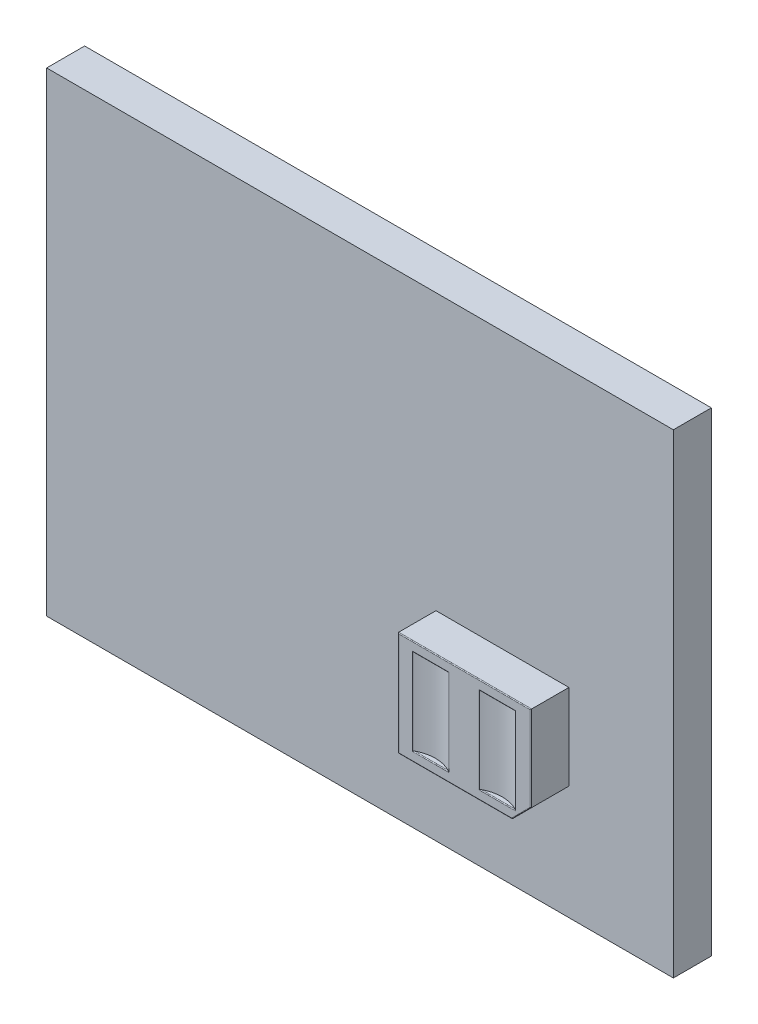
ISO-10303-21;
HEADER;
FILE_DESCRIPTION(('STEP AP214'),'2;1');
FILE_NAME('part.step','',(''),(''),'','','');
FILE_SCHEMA(('AUTOMOTIVE_DESIGN { 1 0 10303 214 1 1 1 1 }'));
ENDSEC;
DATA;
#1=APPLICATION_CONTEXT('core data for automotive mechanical design processes');
#2=APPLICATION_PROTOCOL_DEFINITION('international standard','automotive_design',2000,#1);
#3=PRODUCT_CONTEXT('',#1,'mechanical');
#4=PRODUCT('Part','Part','',(#3));
#5=PRODUCT_RELATED_PRODUCT_CATEGORY('part','',(#4));
#6=PRODUCT_DEFINITION_FORMATION('','',#4);
#7=PRODUCT_DEFINITION_CONTEXT('part definition',#1,'design');
#8=PRODUCT_DEFINITION('design','',#6,#7);
#9=PRODUCT_DEFINITION_SHAPE('','',#8);
#10=(LENGTH_UNIT() NAMED_UNIT(*) SI_UNIT(.MILLI.,.METRE.));
#11=(NAMED_UNIT(*) PLANE_ANGLE_UNIT() SI_UNIT($,.RADIAN.));
#12=(NAMED_UNIT(*) SI_UNIT($,.STERADIAN.) SOLID_ANGLE_UNIT());
#13=UNCERTAINTY_MEASURE_WITH_UNIT(LENGTH_MEASURE(1.E-05),#10,'distance_accuracy_value','');
#14=(GEOMETRIC_REPRESENTATION_CONTEXT(3) GLOBAL_UNCERTAINTY_ASSIGNED_CONTEXT((#13)) GLOBAL_UNIT_ASSIGNED_CONTEXT((#10,
#11,#12)) REPRESENTATION_CONTEXT('',''));
#15=CARTESIAN_POINT('',(0.,0.,0.));
#16=DIRECTION('',(0.,0.,1.));
#17=DIRECTION('',(1.,0.,0.));
#18=AXIS2_PLACEMENT_3D('',#15,#16,#17);
#19=CARTESIAN_POINT('',(2.,-3.75,2.));
#20=DIRECTION('',(0.,0.,1.));
#21=DIRECTION('',(1.,0.,0.));
#22=AXIS2_PLACEMENT_3D('',#19,#20,#21);
#23=PLANE('',#22);
#24=DIRECTION('',(0.,1.,0.));
#25=VECTOR('',#24,1.);
#26=CARTESIAN_POINT('',(3.34009759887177,-3.5,2.));
#27=LINE('',#26,#25);
#28=CARTESIAN_POINT('',(3.34009759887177,-1.23,2.));
#29=VERTEX_POINT('',#28);
#30=CARTESIAN_POINT('',(3.34009759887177,-3.52,2.));
#31=VERTEX_POINT('',#30);
#32=EDGE_CURVE('E279',#29,#31,#27,.F.);
#33=ORIENTED_EDGE('',*,*,#32,.T.);
#34=DIRECTION('',(-1.,0.,0.));
#35=VECTOR('',#34,1.);
#36=CARTESIAN_POINT('',(2.38457281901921,-3.52,2.));
#37=LINE('',#36,#35);
#38=CARTESIAN_POINT('',(2.37925145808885,-3.52,2.));
#39=VERTEX_POINT('',#38);
#40=EDGE_CURVE('E281',#31,#39,#37,.T.);
#41=ORIENTED_EDGE('',*,*,#40,.T.);
#42=DIRECTION('',(0.,1.,0.));
#43=VECTOR('',#42,1.);
#44=CARTESIAN_POINT('',(2.37925145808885,-1.25,2.));
#45=LINE('',#44,#43);
#46=CARTESIAN_POINT('',(2.37925145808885,-1.23,2.));
#47=VERTEX_POINT('',#46);
#48=EDGE_CURVE('E275',#39,#47,#45,.T.);
#49=ORIENTED_EDGE('',*,*,#48,.T.);
#50=DIRECTION('',(-1.,0.,0.));
#51=VECTOR('',#50,1.);
#52=CARTESIAN_POINT('',(2.,-1.23,2.));
#53=LINE('',#52,#51);
#54=EDGE_CURVE('E277',#47,#29,#53,.F.);
#55=ORIENTED_EDGE('',*,*,#54,.T.);
#56=EDGE_LOOP('',(#33,#41,#49,#55));
#57=FACE_BOUND('',#56,.T.);
#58=DIRECTION('',(0.,1.,0.));
#59=VECTOR('',#58,1.);
#60=CARTESIAN_POINT('',(5.48,-1.,2.));
#61=LINE('',#60,#59);
#62=CARTESIAN_POINT('',(5.48,-3.24171572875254,2.));
#63=VERTEX_POINT('',#62);
#64=CARTESIAN_POINT('',(5.48,-1.02,2.));
#65=VERTEX_POINT('',#64);
#66=EDGE_CURVE('E270',#63,#65,#61,.T.);
#67=ORIENTED_EDGE('',*,*,#66,.T.);
#68=DIRECTION('',(-1.,0.,0.));
#69=VECTOR('',#68,1.);
#70=CARTESIAN_POINT('',(2.,-1.02,2.));
#71=LINE('',#70,#69);
#72=CARTESIAN_POINT('',(2.02,-1.02,2.));
#73=VERTEX_POINT('',#72);
#74=EDGE_CURVE('E272',#65,#73,#71,.T.);
#75=ORIENTED_EDGE('',*,*,#74,.T.);
#76=DIRECTION('',(0.,-1.,0.));
#77=VECTOR('',#76,1.);
#78=CARTESIAN_POINT('',(2.02,-3.75,2.));
#79=LINE('',#78,#77);
#80=CARTESIAN_POINT('',(2.02,-3.73,2.));
#81=VERTEX_POINT('',#80);
#82=EDGE_CURVE('E264',#73,#81,#79,.T.);
#83=ORIENTED_EDGE('',*,*,#82,.T.);
#84=DIRECTION('',(1.,0.,0.));
#85=VECTOR('',#84,1.);
#86=CARTESIAN_POINT('',(5.,-3.73,2.));
#87=LINE('',#86,#85);
#88=CARTESIAN_POINT('',(4.99171572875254,-3.73,2.));
#89=VERTEX_POINT('',#88);
#90=EDGE_CURVE('E266',#81,#89,#87,.T.);
#91=ORIENTED_EDGE('',*,*,#90,.T.);
#92=DIRECTION('',(0.707106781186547,0.707106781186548,0.));
#93=VECTOR('',#92,1.);
#94=CARTESIAN_POINT('',(5.48585786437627,-3.23585786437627,2.));
#95=LINE('',#94,#93);
#96=EDGE_CURVE('E268',#89,#63,#95,.T.);
#97=ORIENTED_EDGE('',*,*,#96,.T.);
#98=EDGE_LOOP('',(#67,#75,#83,#91,#97));
#99=FACE_BOUND('',#98,.T.);
#100=DIRECTION('',(-1.,0.,0.));
#101=VECTOR('',#100,1.);
#102=CARTESIAN_POINT('',(2.,-3.52,2.));
#103=LINE('',#102,#101);
#104=CARTESIAN_POINT('',(5.09752708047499,-3.52,2.));
#105=VERTEX_POINT('',#104);
#106=CARTESIAN_POINT('',(4.13668093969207,-3.52,2.));
#107=VERTEX_POINT('',#106);
#108=EDGE_CURVE('E259',#105,#107,#103,.T.);
#109=ORIENTED_EDGE('',*,*,#108,.T.);
#110=DIRECTION('',(0.,1.,0.));
#111=VECTOR('',#110,1.);
#112=CARTESIAN_POINT('',(4.13668093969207,-1.25,2.));
#113=LINE('',#112,#111);
#114=CARTESIAN_POINT('',(4.13668093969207,-1.23,2.));
#115=VERTEX_POINT('',#114);
#116=EDGE_CURVE('E261',#107,#115,#113,.T.);
#117=ORIENTED_EDGE('',*,*,#116,.T.);
#118=DIRECTION('',(-1.,0.,0.));
#119=VECTOR('',#118,1.);
#120=CARTESIAN_POINT('',(5.09220571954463,-1.23,2.));
#121=LINE('',#120,#119);
#122=CARTESIAN_POINT('',(5.09752708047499,-1.23,2.));
#123=VERTEX_POINT('',#122);
#124=EDGE_CURVE('E255',#115,#123,#121,.F.);
#125=ORIENTED_EDGE('',*,*,#124,.T.);
#126=DIRECTION('',(0.,1.,0.));
#127=VECTOR('',#126,1.);
#128=CARTESIAN_POINT('',(5.09752708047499,-3.5,2.));
#129=LINE('',#128,#127);
#130=EDGE_CURVE('E257',#123,#105,#129,.F.);
#131=ORIENTED_EDGE('',*,*,#130,.T.);
#132=EDGE_LOOP('',(#109,#117,#125,#131));
#133=FACE_BOUND('',#132,.T.);
#134=ADVANCED_FACE('F31',(#57,#99,#133),#23,.T.);
#135=CARTESIAN_POINT('',(-8.25,-6.25,1.));
#136=DIRECTION('',(0.,0.,1.));
#137=DIRECTION('',(1.,0.,0.));
#138=AXIS2_PLACEMENT_3D('',#135,#136,#137);
#139=PLANE('',#138);
#140=DIRECTION('',(0.,-1.,0.));
#141=VECTOR('',#140,1.);
#142=CARTESIAN_POINT('',(-8.25,6.25,1.));
#143=LINE('',#142,#141);
#144=CARTESIAN_POINT('',(-8.25,6.25,1.));
#145=VERTEX_POINT('',#144);
#146=CARTESIAN_POINT('',(-8.25,-6.25,1.));
#147=VERTEX_POINT('',#146);
#148=EDGE_CURVE('E234',#145,#147,#143,.T.);
#149=ORIENTED_EDGE('',*,*,#148,.T.);
#150=DIRECTION('',(1.,0.,0.));
#151=VECTOR('',#150,1.);
#152=CARTESIAN_POINT('',(-8.25,-6.25,1.));
#153=LINE('',#152,#151);
#154=CARTESIAN_POINT('',(8.25,-6.25,1.));
#155=VERTEX_POINT('',#154);
#156=EDGE_CURVE('E237',#147,#155,#153,.T.);
#157=ORIENTED_EDGE('',*,*,#156,.T.);
#158=DIRECTION('',(0.,1.,0.));
#159=VECTOR('',#158,1.);
#160=CARTESIAN_POINT('',(8.25,6.25,1.));
#161=LINE('',#160,#159);
#162=CARTESIAN_POINT('',(8.25,6.25,1.));
#163=VERTEX_POINT('',#162);
#164=EDGE_CURVE('E239',#155,#163,#161,.T.);
#165=ORIENTED_EDGE('',*,*,#164,.T.);
#166=DIRECTION('',(-1.,0.,0.));
#167=VECTOR('',#166,1.);
#168=CARTESIAN_POINT('',(-8.25,6.25,1.));
#169=LINE('',#168,#167);
#170=EDGE_CURVE('E241',#163,#145,#169,.T.);
#171=ORIENTED_EDGE('',*,*,#170,.T.);
#172=EDGE_LOOP('',(#149,#157,#165,#171));
#173=FACE_BOUND('',#172,.T.);
#174=DIRECTION('',(-1.,0.,0.));
#175=VECTOR('',#174,1.);
#176=CARTESIAN_POINT('',(-8.25,-3.75,1.));
#177=LINE('',#176,#175);
#178=CARTESIAN_POINT('',(5.,-3.75,1.));
#179=VERTEX_POINT('',#178);
#180=CARTESIAN_POINT('',(2.,-3.75,1.));
#181=VERTEX_POINT('',#180);
#182=EDGE_CURVE('E219',#179,#181,#177,.T.);
#183=ORIENTED_EDGE('',*,*,#182,.T.);
#184=DIRECTION('',(0.,1.,0.));
#185=VECTOR('',#184,1.);
#186=CARTESIAN_POINT('',(2.,-6.25,1.));
#187=LINE('',#186,#185);
#188=CARTESIAN_POINT('',(2.,-1.,1.));
#189=VERTEX_POINT('',#188);
#190=EDGE_CURVE('E196',#181,#189,#187,.T.);
#191=ORIENTED_EDGE('',*,*,#190,.T.);
#192=DIRECTION('',(1.,0.,0.));
#193=VECTOR('',#192,1.);
#194=CARTESIAN_POINT('',(-8.25,-1.,1.));
#195=LINE('',#194,#193);
#196=CARTESIAN_POINT('',(5.5,-1.,1.));
#197=VERTEX_POINT('',#196);
#198=EDGE_CURVE('E207',#189,#197,#195,.T.);
#199=ORIENTED_EDGE('',*,*,#198,.T.);
#200=DIRECTION('',(0.,-1.,0.));
#201=VECTOR('',#200,1.);
#202=CARTESIAN_POINT('',(5.5,-6.25,1.));
#203=LINE('',#202,#201);
#204=CARTESIAN_POINT('',(5.5,-3.25,1.));
#205=VERTEX_POINT('',#204);
#206=EDGE_CURVE('E213',#197,#205,#203,.T.);
#207=ORIENTED_EDGE('',*,*,#206,.T.);
#208=DIRECTION('',(-0.707106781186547,-0.707106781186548,0.));
#209=VECTOR('',#208,1.);
#210=CARTESIAN_POINT('',(-2.87499999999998,-11.625,1.));
#211=LINE('',#210,#209);
#212=EDGE_CURVE('E225',#205,#179,#211,.T.);
#213=ORIENTED_EDGE('',*,*,#212,.T.);
#214=EDGE_LOOP('',(#183,#191,#199,#207,#213));
#215=FACE_BOUND('',#214,.T.);
#216=ADVANCED_FACE('F216',(#173,#215),#139,.T.);
#217=CARTESIAN_POINT('',(-8.25,6.25,1.));
#218=DIRECTION('',(1.,0.,0.));
#219=DIRECTION('',(0.,0.,-1.));
#220=AXIS2_PLACEMENT_3D('',#217,#218,#219);
#221=PLANE('',#220);
#222=DIRECTION('',(0.,-1.,0.));
#223=VECTOR('',#222,1.);
#224=CARTESIAN_POINT('',(-8.25,6.25,0.));
#225=LINE('',#224,#223);
#226=CARTESIAN_POINT('',(-8.25,6.25,0.));
#227=VERTEX_POINT('',#226);
#228=CARTESIAN_POINT('',(-8.25,-6.25,0.));
#229=VERTEX_POINT('',#228);
#230=EDGE_CURVE('E220',#227,#229,#225,.T.);
#231=ORIENTED_EDGE('',*,*,#230,.T.);
#232=DIRECTION('',(0.,0.,-1.));
#233=VECTOR('',#232,1.);
#234=CARTESIAN_POINT('',(-8.25,-6.25,1.));
#235=LINE('',#234,#233);
#236=EDGE_CURVE('E252',#147,#229,#235,.T.);
#237=ORIENTED_EDGE('',*,*,#236,.F.);
#238=ORIENTED_EDGE('',*,*,#148,.F.);
#239=DIRECTION('',(0.,0.,-1.));
#240=VECTOR('',#239,1.);
#241=CARTESIAN_POINT('',(-8.25,6.25,1.));
#242=LINE('',#241,#240);
#243=EDGE_CURVE('E243',#145,#227,#242,.T.);
#244=ORIENTED_EDGE('',*,*,#243,.T.);
#245=EDGE_LOOP('',(#231,#237,#238,#244));
#246=FACE_BOUND('',#245,.T.);
#247=ADVANCED_FACE('F33',(#246),#221,.F.);
#248=CARTESIAN_POINT('',(-8.25,-6.25,1.));
#249=DIRECTION('',(0.,1.,0.));
#250=DIRECTION('',(0.,0.,1.));
#251=AXIS2_PLACEMENT_3D('',#248,#249,#250);
#252=PLANE('',#251);
#253=DIRECTION('',(1.,0.,0.));
#254=VECTOR('',#253,1.);
#255=CARTESIAN_POINT('',(-8.25,-6.25,0.));
#256=LINE('',#255,#254);
#257=CARTESIAN_POINT('',(8.25,-6.25,0.));
#258=VERTEX_POINT('',#257);
#259=EDGE_CURVE('E223',#229,#258,#256,.T.);
#260=ORIENTED_EDGE('',*,*,#259,.T.);
#261=DIRECTION('',(0.,0.,-1.));
#262=VECTOR('',#261,1.);
#263=CARTESIAN_POINT('',(8.25,-6.25,1.));
#264=LINE('',#263,#262);
#265=EDGE_CURVE('E249',#155,#258,#264,.T.);
#266=ORIENTED_EDGE('',*,*,#265,.F.);
#267=ORIENTED_EDGE('',*,*,#156,.F.);
#268=ORIENTED_EDGE('',*,*,#236,.T.);
#269=EDGE_LOOP('',(#260,#266,#267,#268));
#270=FACE_BOUND('',#269,.T.);
#271=ADVANCED_FACE('F663',(#270),#252,.F.);
#272=CARTESIAN_POINT('',(8.25,6.25,1.));
#273=DIRECTION('',(-1.,0.,0.));
#274=DIRECTION('',(0.,0.,1.));
#275=AXIS2_PLACEMENT_3D('',#272,#273,#274);
#276=PLANE('',#275);
#277=DIRECTION('',(0.,1.,0.));
#278=VECTOR('',#277,1.);
#279=CARTESIAN_POINT('',(8.25,6.25,0.));
#280=LINE('',#279,#278);
#281=CARTESIAN_POINT('',(8.25,6.25,0.));
#282=VERTEX_POINT('',#281);
#283=EDGE_CURVE('E230',#258,#282,#280,.T.);
#284=ORIENTED_EDGE('',*,*,#283,.T.);
#285=DIRECTION('',(0.,0.,-1.));
#286=VECTOR('',#285,1.);
#287=CARTESIAN_POINT('',(8.25,6.25,1.));
#288=LINE('',#287,#286);
#289=EDGE_CURVE('E246',#163,#282,#288,.T.);
#290=ORIENTED_EDGE('',*,*,#289,.F.);
#291=ORIENTED_EDGE('',*,*,#164,.F.);
#292=ORIENTED_EDGE('',*,*,#265,.T.);
#293=EDGE_LOOP('',(#284,#290,#291,#292));
#294=FACE_BOUND('',#293,.T.);
#295=ADVANCED_FACE('F653',(#294),#276,.F.);
#296=CARTESIAN_POINT('',(-8.25,6.25,1.));
#297=DIRECTION('',(0.,-1.,0.));
#298=DIRECTION('',(0.,0.,-1.));
#299=AXIS2_PLACEMENT_3D('',#296,#297,#298);
#300=PLANE('',#299);
#301=DIRECTION('',(-1.,0.,0.));
#302=VECTOR('',#301,1.);
#303=CARTESIAN_POINT('',(-8.25,6.25,0.));
#304=LINE('',#303,#302);
#305=EDGE_CURVE('E232',#282,#227,#304,.T.);
#306=ORIENTED_EDGE('',*,*,#305,.T.);
#307=ORIENTED_EDGE('',*,*,#243,.F.);
#308=ORIENTED_EDGE('',*,*,#170,.F.);
#309=ORIENTED_EDGE('',*,*,#289,.T.);
#310=EDGE_LOOP('',(#306,#307,#308,#309));
#311=FACE_BOUND('',#310,.T.);
#312=ADVANCED_FACE('F635',(#311),#300,.F.);
#313=CARTESIAN_POINT('',(-8.25,-6.25,0.));
#314=DIRECTION('',(0.,0.,1.));
#315=DIRECTION('',(1.,0.,0.));
#316=AXIS2_PLACEMENT_3D('',#313,#314,#315);
#317=PLANE('',#316);
#318=ORIENTED_EDGE('',*,*,#230,.F.);
#319=ORIENTED_EDGE('',*,*,#305,.F.);
#320=ORIENTED_EDGE('',*,*,#283,.F.);
#321=ORIENTED_EDGE('',*,*,#259,.F.);
#322=EDGE_LOOP('',(#318,#319,#320,#321));
#323=FACE_BOUND('',#322,.T.);
#324=ADVANCED_FACE('F619',(#323),#317,.F.);
#325=CARTESIAN_POINT('',(2.,-3.75,2.));
#326=DIRECTION('',(1.,0.,0.));
#327=DIRECTION('',(0.,1.,0.));
#328=AXIS2_PLACEMENT_3D('',#325,#326,#327);
#329=PLANE('',#328);
#330=DIRECTION('',(0.,0.,-1.));
#331=VECTOR('',#330,1.);
#332=CARTESIAN_POINT('',(2.,-3.75,2.));
#333=LINE('',#332,#331);
#334=CARTESIAN_POINT('',(2.,-3.75,1.98));
#335=VERTEX_POINT('',#334);
#336=EDGE_CURVE('E214',#335,#181,#333,.T.);
#337=ORIENTED_EDGE('',*,*,#336,.F.);
#338=DIRECTION('',(0.,-1.,0.));
#339=VECTOR('',#338,1.);
#340=CARTESIAN_POINT('',(2.,-1.,1.98));
#341=LINE('',#340,#339);
#342=CARTESIAN_POINT('',(2.,-1.,1.98));
#343=VERTEX_POINT('',#342);
#344=EDGE_CURVE('E199',#335,#343,#341,.F.);
#345=ORIENTED_EDGE('',*,*,#344,.T.);
#346=DIRECTION('',(0.,0.,-1.));
#347=VECTOR('',#346,1.);
#348=CARTESIAN_POINT('',(2.,-1.,2.));
#349=LINE('',#348,#347);
#350=EDGE_CURVE('E191',#343,#189,#349,.T.);
#351=ORIENTED_EDGE('',*,*,#350,.T.);
#352=ORIENTED_EDGE('',*,*,#190,.F.);
#353=EDGE_LOOP('',(#337,#345,#351,#352));
#354=FACE_BOUND('',#353,.T.);
#355=ADVANCED_FACE('F194',(#354),#329,.F.);
#356=CARTESIAN_POINT('',(5.,-3.75,2.));
#357=DIRECTION('',(0.,1.,0.));
#358=DIRECTION('',(-1.,0.,0.));
#359=AXIS2_PLACEMENT_3D('',#356,#357,#358);
#360=PLANE('',#359);
#361=DIRECTION('',(0.,0.,-1.));
#362=VECTOR('',#361,1.);
#363=CARTESIAN_POINT('',(5.,-3.75,2.));
#364=LINE('',#363,#362);
#365=CARTESIAN_POINT('',(5.,-3.75,1.98));
#366=VERTEX_POINT('',#365);
#367=EDGE_CURVE('E450',#366,#179,#364,.T.);
#368=ORIENTED_EDGE('',*,*,#367,.F.);
#369=DIRECTION('',(1.,0.,0.));
#370=VECTOR('',#369,1.);
#371=CARTESIAN_POINT('',(2.,-3.75,1.98));
#372=LINE('',#371,#370);
#373=EDGE_CURVE('E299',#366,#335,#372,.F.);
#374=ORIENTED_EDGE('',*,*,#373,.T.);
#375=ORIENTED_EDGE('',*,*,#336,.T.);
#376=ORIENTED_EDGE('',*,*,#182,.F.);
#377=EDGE_LOOP('',(#368,#374,#375,#376));
#378=FACE_BOUND('',#377,.T.);
#379=ADVANCED_FACE('F461',(#378),#360,.F.);
#380=CARTESIAN_POINT('',(5.5,-3.25,2.));
#381=DIRECTION('',(-0.707106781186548,0.707106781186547,0.));
#382=DIRECTION('',(-0.707106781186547,-0.707106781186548,0.));
#383=AXIS2_PLACEMENT_3D('',#380,#381,#382);
#384=PLANE('',#383);
#385=DIRECTION('',(0.,0.,-1.));
#386=VECTOR('',#385,1.);
#387=CARTESIAN_POINT('',(5.5,-3.25,2.));
#388=LINE('',#387,#386);
#389=CARTESIAN_POINT('',(5.5,-3.25,1.98));
#390=VERTEX_POINT('',#389);
#391=EDGE_CURVE('E448',#390,#205,#388,.T.);
#392=ORIENTED_EDGE('',*,*,#391,.F.);
#393=DIRECTION('',(0.707106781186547,0.707106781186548,0.));
#394=VECTOR('',#393,1.);
#395=CARTESIAN_POINT('',(5.,-3.75,1.98));
#396=LINE('',#395,#394);
#397=EDGE_CURVE('E297',#390,#366,#396,.F.);
#398=ORIENTED_EDGE('',*,*,#397,.T.);
#399=ORIENTED_EDGE('',*,*,#367,.T.);
#400=ORIENTED_EDGE('',*,*,#212,.F.);
#401=EDGE_LOOP('',(#392,#398,#399,#400));
#402=FACE_BOUND('',#401,.T.);
#403=ADVANCED_FACE('F456',(#402),#384,.F.);
#404=CARTESIAN_POINT('',(5.5,-1.,2.));
#405=DIRECTION('',(-1.,0.,0.));
#406=DIRECTION('',(0.,0.,1.));
#407=AXIS2_PLACEMENT_3D('',#404,#405,#406);
#408=PLANE('',#407);
#409=DIRECTION('',(0.,0.,-1.));
#410=VECTOR('',#409,1.);
#411=CARTESIAN_POINT('',(5.5,-1.,2.));
#412=LINE('',#411,#410);
#413=CARTESIAN_POINT('',(5.5,-1.,1.98));
#414=VERTEX_POINT('',#413);
#415=EDGE_CURVE('E203',#414,#197,#412,.T.);
#416=ORIENTED_EDGE('',*,*,#415,.F.);
#417=DIRECTION('',(0.,1.,0.));
#418=VECTOR('',#417,1.);
#419=CARTESIAN_POINT('',(5.5,-3.25,1.98));
#420=LINE('',#419,#418);
#421=EDGE_CURVE('E295',#414,#390,#420,.F.);
#422=ORIENTED_EDGE('',*,*,#421,.T.);
#423=ORIENTED_EDGE('',*,*,#391,.T.);
#424=ORIENTED_EDGE('',*,*,#206,.F.);
#425=EDGE_LOOP('',(#416,#422,#423,#424));
#426=FACE_BOUND('',#425,.T.);
#427=ADVANCED_FACE('F477',(#426),#408,.F.);
#428=CARTESIAN_POINT('',(2.,-1.,2.));
#429=DIRECTION('',(0.,-1.,0.));
#430=DIRECTION('',(0.,0.,-1.));
#431=AXIS2_PLACEMENT_3D('',#428,#429,#430);
#432=PLANE('',#431);
#433=ORIENTED_EDGE('',*,*,#350,.F.);
#434=DIRECTION('',(-1.,0.,0.));
#435=VECTOR('',#434,1.);
#436=CARTESIAN_POINT('',(5.5,-1.,1.98));
#437=LINE('',#436,#435);
#438=EDGE_CURVE('E293',#343,#414,#437,.F.);
#439=ORIENTED_EDGE('',*,*,#438,.T.);
#440=ORIENTED_EDGE('',*,*,#415,.T.);
#441=ORIENTED_EDGE('',*,*,#198,.F.);
#442=EDGE_LOOP('',(#433,#439,#440,#441));
#443=FACE_BOUND('',#442,.T.);
#444=ADVANCED_FACE('F208',(#443),#432,.F.);
#445=CARTESIAN_POINT('',(2.85967452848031,-1.25,2.82428912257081));
#446=DIRECTION('',(0.,-1.,0.));
#447=DIRECTION('',(0.,0.,-1.));
#448=AXIS2_PLACEMENT_3D('',#445,#446,#447);
#449=CYLINDRICAL_SURFACE('',#448,0.95140642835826);
#450=CARTESIAN_POINT('',(3.29825185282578,-3.5,1.98));
#451=CARTESIAN_POINT('',(3.30030143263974,-3.50000121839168,1.98106471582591));
#452=CARTESIAN_POINT('',(3.30234482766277,-3.50008460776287,1.98213566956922));
#453=CARTESIAN_POINT('',(3.30642373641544,-3.5004352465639,1.9842922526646));
#454=CARTESIAN_POINT('',(3.30845912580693,-3.50070361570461,1.98537793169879));
#455=CARTESIAN_POINT('',(3.31432945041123,-3.5017791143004,1.98853680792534));
#456=CARTESIAN_POINT('',(3.31812678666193,-3.50285399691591,1.99061495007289));
#457=CARTESIAN_POINT('',(3.32324263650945,-3.50516501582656,1.99345711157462));
#458=CARTESIAN_POINT('',(3.32472361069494,-3.50594762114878,1.99428546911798));
#459=CARTESIAN_POINT('',(3.3275757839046,-3.50779498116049,1.99588979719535));
#460=CARTESIAN_POINT('',(3.32894432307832,-3.50886487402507,1.99666445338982));
#461=CARTESIAN_POINT('',(3.33020631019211,-3.51010871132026,1.9973828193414));
#462=B_SPLINE_CURVE_WITH_KNOTS('',3,(#450,#451,#452,#453,#454,#455,#456,#457,#458,#459,#460,
#461),.UNSPECIFIED.,.F.,.F.,(4,2,2,2,2,4),(0.,0.00692143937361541,0.0138851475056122,
0.027147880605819,0.0327331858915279,0.0384259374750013),.UNSPECIFIED.);
#463=CARTESIAN_POINT('',(3.29825185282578,-3.5,1.98));
#464=VERTEX_POINT('',#463);
#465=CARTESIAN_POINT('',(3.33020631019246,-3.51010871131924,1.9973828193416));
#466=VERTEX_POINT('',#465);
#467=EDGE_CURVE('E316',#464,#466,#462,.T.);
#468=ORIENTED_EDGE('',*,*,#467,.T.);
#469=DIRECTION('',(0.,-1.,0.));
#470=VECTOR('',#469,1.);
#471=CARTESIAN_POINT('',(3.33020631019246,-1.25,1.9973828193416));
#472=LINE('',#471,#470);
#473=CARTESIAN_POINT('',(3.33020631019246,-1.23989128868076,1.9973828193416));
#474=VERTEX_POINT('',#473);
#475=EDGE_CURVE('E289',#466,#474,#472,.F.);
#476=ORIENTED_EDGE('',*,*,#475,.T.);
#477=CARTESIAN_POINT('',(3.33020631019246,-1.23989128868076,1.9973828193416));
#478=CARTESIAN_POINT('',(3.32907457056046,-1.24101003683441,1.99673862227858));
#479=CARTESIAN_POINT('',(3.32785338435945,-1.24198753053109,1.99604700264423));
#480=CARTESIAN_POINT('',(3.32530170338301,-1.24370587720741,1.99460993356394));
#481=CARTESIAN_POINT('',(3.32397241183,-1.24444897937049,1.99386508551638));
#482=CARTESIAN_POINT('',(3.32006330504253,-1.24633742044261,1.99168783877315));
#483=CARTESIAN_POINT('',(3.31740293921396,-1.24726919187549,1.99022177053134));
#484=CARTESIAN_POINT('',(3.31196357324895,-1.24870863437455,1.98725952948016));
#485=CARTESIAN_POINT('',(3.30918374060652,-1.24921253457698,1.98576320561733));
#486=CARTESIAN_POINT('',(3.30502790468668,-1.24969551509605,1.98355318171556));
#487=CARTESIAN_POINT('',(3.3036687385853,-1.24981123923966,1.98283460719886));
#488=CARTESIAN_POINT('',(3.30095755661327,-1.24996295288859,1.98140965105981));
#489=CARTESIAN_POINT('',(3.29960561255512,-1.24999975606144,1.98070322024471));
#490=CARTESIAN_POINT('',(3.29825185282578,-1.25,1.98));
#491=B_SPLINE_CURVE_WITH_KNOTS('',3,(#477,#478,#479,#480,#481,#482,#483,#484,#485,#486,#487,
#488,#489,#490),.UNSPECIFIED.,.F.,.F.,(4,2,2,2,2,2,4),(0.,0.00511946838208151,
0.0101882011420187,0.0196727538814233,0.0292400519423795,0.033863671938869,0.038439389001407),.UNSPECIFIED.);
#492=CARTESIAN_POINT('',(3.29825185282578,-1.25,1.98));
#493=VERTEX_POINT('',#492);
#494=EDGE_CURVE('E355',#474,#493,#491,.T.);
#495=ORIENTED_EDGE('',*,*,#494,.T.);
#496=CARTESIAN_POINT('',(2.85967452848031,-1.25,2.82428912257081));
#497=DIRECTION('',(0.,-1.,0.));
#498=DIRECTION('',(0.,0.,-1.));
#499=AXIS2_PLACEMENT_3D('',#496,#497,#498);
#500=CIRCLE('',#499,0.95140642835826);
#501=CARTESIAN_POINT('',(2.42109720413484,-1.25,1.98));
#502=VERTEX_POINT('',#501);
#503=EDGE_CURVE('E204',#502,#493,#500,.T.);
#504=ORIENTED_EDGE('',*,*,#503,.F.);
#505=CARTESIAN_POINT('',(2.42109720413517,-1.25,1.97999999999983));
#506=CARTESIAN_POINT('',(2.41904762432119,-1.24999878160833,1.98106471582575));
#507=CARTESIAN_POINT('',(2.41700422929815,-1.24991539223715,1.98213566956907));
#508=CARTESIAN_POINT('',(2.41292532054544,-1.24956475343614,1.98429225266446));
#509=CARTESIAN_POINT('',(2.41088993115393,-1.24929638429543,1.98537793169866));
#510=CARTESIAN_POINT('',(2.40501960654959,-1.24822088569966,1.98853680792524));
#511=CARTESIAN_POINT('',(2.40122227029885,-1.24714600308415,1.9906149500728));
#512=CARTESIAN_POINT('',(2.39610642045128,-1.2448349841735,1.99345711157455));
#513=CARTESIAN_POINT('',(2.39462544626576,-1.24405237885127,1.99428546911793));
#514=CARTESIAN_POINT('',(2.39177327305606,-1.24220501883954,1.99588979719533));
#515=CARTESIAN_POINT('',(2.39040473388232,-1.24113512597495,1.99666445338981));
#516=CARTESIAN_POINT('',(2.38914274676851,-1.23989128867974,1.9973828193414));
#517=B_SPLINE_CURVE_WITH_KNOTS('',3,(#505,#506,#507,#508,#509,#510,#511,#512,#513,#514,#515,
#516),.UNSPECIFIED.,.F.,.F.,(4,2,2,2,2,4),(0.,0.00692143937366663,0.0138851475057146,
0.0271478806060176,0.0327331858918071,0.0384259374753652),.UNSPECIFIED.);
#518=CARTESIAN_POINT('',(2.38914274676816,-1.23989128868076,1.9973828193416));
#519=VERTEX_POINT('',#518);
#520=EDGE_CURVE('E350',#502,#519,#517,.T.);
#521=ORIENTED_EDGE('',*,*,#520,.T.);
#522=DIRECTION('',(0.,-1.,0.));
#523=VECTOR('',#522,1.);
#524=CARTESIAN_POINT('',(2.38914274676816,-1.25,1.9973828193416));
#525=LINE('',#524,#523);
#526=CARTESIAN_POINT('',(2.38914274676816,-3.51010871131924,1.9973828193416));
#527=VERTEX_POINT('',#526);
#528=EDGE_CURVE('E287',#519,#527,#525,.T.);
#529=ORIENTED_EDGE('',*,*,#528,.T.);
#530=CARTESIAN_POINT('',(2.38914274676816,-3.51010871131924,1.9973828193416));
#531=CARTESIAN_POINT('',(2.39027448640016,-3.5089899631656,1.99673862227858));
#532=CARTESIAN_POINT('',(2.39149567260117,-3.50801246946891,1.99604700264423));
#533=CARTESIAN_POINT('',(2.39404735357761,-3.50629412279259,1.99460993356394));
#534=CARTESIAN_POINT('',(2.39537664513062,-3.50555102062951,1.99386508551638));
#535=CARTESIAN_POINT('',(2.39928575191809,-3.50366257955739,1.99168783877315));
#536=CARTESIAN_POINT('',(2.40194611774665,-3.50273080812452,1.99022177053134));
#537=CARTESIAN_POINT('',(2.40738548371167,-3.50129136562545,1.98725952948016));
#538=CARTESIAN_POINT('',(2.4101653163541,-3.50078746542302,1.98576320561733));
#539=CARTESIAN_POINT('',(2.41432115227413,-3.50030448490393,1.98355318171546));
#540=CARTESIAN_POINT('',(2.41568031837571,-3.50018876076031,1.98283460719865));
#541=CARTESIAN_POINT('',(2.41839150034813,-3.50003704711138,1.98140965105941));
#542=CARTESIAN_POINT('',(2.41974344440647,-3.50000024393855,1.9807032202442));
#543=CARTESIAN_POINT('',(2.42109720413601,-3.5,1.9799999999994));
#544=B_SPLINE_CURVE_WITH_KNOTS('',3,(#530,#531,#532,#533,#534,#535,#536,#537,#538,#539,#540,
#541,#542,#543),.UNSPECIFIED.,.F.,.F.,(4,2,2,2,2,2,4),(0.,0.00511946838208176,
0.0101882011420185,0.0196727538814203,0.0292400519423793,0.0338636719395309,0.0384393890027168),.UNSPECIFIED.);
#545=CARTESIAN_POINT('',(2.42109720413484,-3.5,1.98));
#546=VERTEX_POINT('',#545);
#547=EDGE_CURVE('E309',#527,#546,#544,.T.);
#548=ORIENTED_EDGE('',*,*,#547,.T.);
#549=CARTESIAN_POINT('',(2.85967452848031,-3.5,2.82428912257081));
#550=DIRECTION('',(0.,-1.,0.));
#551=DIRECTION('',(0.,0.,-1.));
#552=AXIS2_PLACEMENT_3D('',#549,#550,#551);
#553=CIRCLE('',#552,0.95140642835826);
#554=EDGE_CURVE('E442',#546,#464,#553,.T.);
#555=ORIENTED_EDGE('',*,*,#554,.T.);
#556=EDGE_LOOP('',(#468,#476,#495,#504,#521,#529,#548,#555));
#557=FACE_BOUND('',#556,.T.);
#558=ADVANCED_FACE('F321',(#557),#449,.F.);
#559=CARTESIAN_POINT('',(2.85967452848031,-1.25,2.82428912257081));
#560=DIRECTION('',(0.,-1.,0.));
#561=DIRECTION('',(0.,0.,-1.));
#562=AXIS2_PLACEMENT_3D('',#559,#560,#561);
#563=PLANE('',#562);
#564=ORIENTED_EDGE('',*,*,#503,.T.);
#565=DIRECTION('',(-1.,0.,0.));
#566=VECTOR('',#565,1.);
#567=CARTESIAN_POINT('',(2.85967452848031,-1.25,1.98));
#568=LINE('',#567,#566);
#569=EDGE_CURVE('E291',#493,#502,#568,.T.);
#570=ORIENTED_EDGE('',*,*,#569,.T.);
#571=EDGE_LOOP('',(#564,#570));
#572=FACE_BOUND('',#571,.T.);
#573=ADVANCED_FACE('F561',(#572),#563,.T.);
#574=CARTESIAN_POINT('',(2.85967452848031,-3.5,2.82428912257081));
#575=DIRECTION('',(0.,-1.,0.));
#576=DIRECTION('',(0.,0.,-1.));
#577=AXIS2_PLACEMENT_3D('',#574,#575,#576);
#578=PLANE('',#577);
#579=ORIENTED_EDGE('',*,*,#554,.F.);
#580=DIRECTION('',(-1.,0.,0.));
#581=VECTOR('',#580,1.);
#582=CARTESIAN_POINT('',(3.33477623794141,-3.5,1.98));
#583=LINE('',#582,#581);
#584=EDGE_CURVE('E284',#546,#464,#583,.F.);
#585=ORIENTED_EDGE('',*,*,#584,.T.);
#586=EDGE_LOOP('',(#579,#585));
#587=FACE_BOUND('',#586,.T.);
#588=ADVANCED_FACE('F503',(#587),#578,.F.);
#589=CARTESIAN_POINT('',(4.61710401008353,-1.25,2.82428912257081));
#590=DIRECTION('',(0.,-1.,0.));
#591=DIRECTION('',(0.,0.,-1.));
#592=AXIS2_PLACEMENT_3D('',#589,#590,#591);
#593=CYLINDRICAL_SURFACE('',#592,0.95140642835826);
#594=CARTESIAN_POINT('',(4.61710401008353,-1.25,2.82428912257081));
#595=DIRECTION('',(0.,-1.,0.));
#596=DIRECTION('',(0.,0.,1.));
#597=AXIS2_PLACEMENT_3D('',#594,#595,#596);
#598=CIRCLE('',#597,0.95140642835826);
#599=CARTESIAN_POINT('',(4.17852668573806,-1.25,1.98));
#600=VERTEX_POINT('',#599);
#601=CARTESIAN_POINT('',(5.05568133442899,-1.25,1.98));
#602=VERTEX_POINT('',#601);
#603=EDGE_CURVE('E439',#600,#602,#598,.T.);
#604=ORIENTED_EDGE('',*,*,#603,.F.);
#605=CARTESIAN_POINT('',(4.17852668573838,-1.25,1.97999999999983));
#606=CARTESIAN_POINT('',(4.17647710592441,-1.24999878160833,1.98106471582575));
#607=CARTESIAN_POINT('',(4.17443371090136,-1.24991539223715,1.98213566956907));
#608=CARTESIAN_POINT('',(4.17035480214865,-1.24956475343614,1.98429225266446));
#609=CARTESIAN_POINT('',(4.16831941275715,-1.24929638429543,1.98537793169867));
#610=CARTESIAN_POINT('',(4.16244908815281,-1.24822088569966,1.98853680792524));
#611=CARTESIAN_POINT('',(4.15865175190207,-1.24714600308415,1.9906149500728));
#612=CARTESIAN_POINT('',(4.1535359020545,-1.2448349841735,1.99345711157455));
#613=CARTESIAN_POINT('',(4.15205492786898,-1.24405237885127,1.99428546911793));
#614=CARTESIAN_POINT('',(4.14920275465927,-1.24220501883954,1.99588979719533));
#615=CARTESIAN_POINT('',(4.14783421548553,-1.24113512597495,1.99666445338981));
#616=CARTESIAN_POINT('',(4.14657222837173,-1.23989128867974,1.9973828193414));
#617=B_SPLINE_CURVE_WITH_KNOTS('',3,(#605,#606,#607,#608,#609,#610,#611,#612,#613,#614,#615,
#616),.UNSPECIFIED.,.F.,.F.,(4,2,2,2,2,4),(0.,0.00692143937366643,0.0138851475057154,
0.0271478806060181,0.0327331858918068,0.038425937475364),.UNSPECIFIED.);
#618=CARTESIAN_POINT('',(4.14657222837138,-1.23989128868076,1.9973828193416));
#619=VERTEX_POINT('',#618);
#620=EDGE_CURVE('E44',#600,#619,#617,.T.);
#621=ORIENTED_EDGE('',*,*,#620,.T.);
#622=DIRECTION('',(0.,-1.,0.));
#623=VECTOR('',#622,1.);
#624=CARTESIAN_POINT('',(4.14657222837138,-1.25,1.9973828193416));
#625=LINE('',#624,#623);
#626=CARTESIAN_POINT('',(4.14657222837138,-3.51010871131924,1.9973828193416));
#627=VERTEX_POINT('',#626);
#628=EDGE_CURVE('E303',#619,#627,#625,.T.);
#629=ORIENTED_EDGE('',*,*,#628,.T.);
#630=CARTESIAN_POINT('',(4.14657222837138,-3.51010871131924,1.9973828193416));
#631=CARTESIAN_POINT('',(4.14770396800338,-3.5089899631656,1.99673862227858));
#632=CARTESIAN_POINT('',(4.14892515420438,-3.50801246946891,1.99604700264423));
#633=CARTESIAN_POINT('',(4.15147683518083,-3.50629412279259,1.99460993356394));
#634=CARTESIAN_POINT('',(4.15280612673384,-3.50555102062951,1.99386508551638));
#635=CARTESIAN_POINT('',(4.15671523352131,-3.50366257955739,1.99168783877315));
#636=CARTESIAN_POINT('',(4.15937559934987,-3.50273080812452,1.99022177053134));
#637=CARTESIAN_POINT('',(4.16481496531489,-3.50129136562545,1.98725952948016));
#638=CARTESIAN_POINT('',(4.16759479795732,-3.50078746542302,1.98576320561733));
#639=CARTESIAN_POINT('',(4.17175063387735,-3.50030448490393,1.98355318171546));
#640=CARTESIAN_POINT('',(4.17310979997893,-3.50018876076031,1.98283460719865));
#641=CARTESIAN_POINT('',(4.17582098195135,-3.50003704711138,1.98140965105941));
#642=CARTESIAN_POINT('',(4.17717292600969,-3.50000024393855,1.9807032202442));
#643=CARTESIAN_POINT('',(4.17852668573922,-3.5,1.9799999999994));
#644=B_SPLINE_CURVE_WITH_KNOTS('',3,(#630,#631,#632,#633,#634,#635,#636,#637,#638,#639,#640,
#641,#642,#643),.UNSPECIFIED.,.F.,.F.,(4,2,2,2,2,2,4),(0.,0.00511946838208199,
0.0101882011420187,0.0196727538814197,0.0292400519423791,0.0338636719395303,0.0384393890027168),.UNSPECIFIED.);
#645=CARTESIAN_POINT('',(4.17852668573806,-3.5,1.98));
#646=VERTEX_POINT('',#645);
#647=EDGE_CURVE('E360',#627,#646,#644,.T.);
#648=ORIENTED_EDGE('',*,*,#647,.T.);
#649=CARTESIAN_POINT('',(4.61710401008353,-3.5,2.82428912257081));
#650=DIRECTION('',(0.,-1.,0.));
#651=DIRECTION('',(0.,0.,1.));
#652=AXIS2_PLACEMENT_3D('',#649,#650,#651);
#653=CIRCLE('',#652,0.95140642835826);
#654=CARTESIAN_POINT('',(5.05568133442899,-3.5,1.98));
#655=VERTEX_POINT('',#654);
#656=EDGE_CURVE('E399',#646,#655,#653,.T.);
#657=ORIENTED_EDGE('',*,*,#656,.T.);
#658=CARTESIAN_POINT('',(5.05568133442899,-3.5,1.98));
#659=CARTESIAN_POINT('',(5.05773091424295,-3.50000121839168,1.98106471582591));
#660=CARTESIAN_POINT('',(5.05977430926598,-3.50008460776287,1.98213566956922));
#661=CARTESIAN_POINT('',(5.06385321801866,-3.5004352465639,1.9842922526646));
#662=CARTESIAN_POINT('',(5.06588860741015,-3.50070361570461,1.9853779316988));
#663=CARTESIAN_POINT('',(5.07175893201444,-3.5017791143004,1.98853680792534));
#664=CARTESIAN_POINT('',(5.07555626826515,-3.50285399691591,1.99061495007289));
#665=CARTESIAN_POINT('',(5.08067211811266,-3.50516501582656,1.99345711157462));
#666=CARTESIAN_POINT('',(5.08215309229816,-3.50594762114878,1.99428546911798));
#667=CARTESIAN_POINT('',(5.08500526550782,-3.50779498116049,1.99588979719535));
#668=CARTESIAN_POINT('',(5.08637380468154,-3.50886487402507,1.99666445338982));
#669=CARTESIAN_POINT('',(5.08763579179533,-3.51010871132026,1.9973828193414));
#670=B_SPLINE_CURVE_WITH_KNOTS('',3,(#658,#659,#660,#661,#662,#663,#664,#665,#666,#667,#668,
#669),.UNSPECIFIED.,.F.,.F.,(4,2,2,2,2,4),(0.,0.00692143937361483,0.0138851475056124,
0.0271478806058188,0.0327331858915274,0.038425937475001),.UNSPECIFIED.);
#671=CARTESIAN_POINT('',(5.08763579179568,-3.51010871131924,1.9973828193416));
#672=VERTEX_POINT('',#671);
#673=EDGE_CURVE('E366',#655,#672,#670,.T.);
#674=ORIENTED_EDGE('',*,*,#673,.T.);
#675=DIRECTION('',(0.,-1.,0.));
#676=VECTOR('',#675,1.);
#677=CARTESIAN_POINT('',(5.08763579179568,-1.25,1.9973828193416));
#678=LINE('',#677,#676);
#679=CARTESIAN_POINT('',(5.08763579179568,-1.23989128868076,1.9973828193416));
#680=VERTEX_POINT('',#679);
#681=EDGE_CURVE('E50',#672,#680,#678,.F.);
#682=ORIENTED_EDGE('',*,*,#681,.T.);
#683=CARTESIAN_POINT('',(5.08763579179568,-1.23989128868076,1.9973828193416));
#684=CARTESIAN_POINT('',(5.08650405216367,-1.24101003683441,1.99673862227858));
#685=CARTESIAN_POINT('',(5.08528286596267,-1.24198753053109,1.99604700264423));
#686=CARTESIAN_POINT('',(5.08273118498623,-1.24370587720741,1.99460993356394));
#687=CARTESIAN_POINT('',(5.08140189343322,-1.24444897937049,1.99386508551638));
#688=CARTESIAN_POINT('',(5.07749278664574,-1.24633742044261,1.99168783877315));
#689=CARTESIAN_POINT('',(5.07483242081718,-1.24726919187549,1.99022177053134));
#690=CARTESIAN_POINT('',(5.06939305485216,-1.24870863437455,1.98725952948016));
#691=CARTESIAN_POINT('',(5.06661322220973,-1.24921253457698,1.98576320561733));
#692=CARTESIAN_POINT('',(5.0624573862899,-1.24969551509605,1.98355318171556));
#693=CARTESIAN_POINT('',(5.06109822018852,-1.24981123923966,1.98283460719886));
#694=CARTESIAN_POINT('',(5.05838703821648,-1.24996295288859,1.98140965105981));
#695=CARTESIAN_POINT('',(5.05703509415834,-1.24999975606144,1.98070322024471));
#696=CARTESIAN_POINT('',(5.05568133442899,-1.25,1.98));
#697=B_SPLINE_CURVE_WITH_KNOTS('',3,(#683,#684,#685,#686,#687,#688,#689,#690,#691,#692,#693,
#694,#695,#696),.UNSPECIFIED.,.F.,.F.,(4,2,2,2,2,2,4),(0.,0.00511946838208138,
0.0101882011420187,0.0196727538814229,0.0292400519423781,0.0338636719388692,0.0384393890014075),.UNSPECIFIED.);
#698=EDGE_CURVE('E11',#680,#602,#697,.T.);
#699=ORIENTED_EDGE('',*,*,#698,.T.);
#700=EDGE_LOOP('',(#604,#621,#629,#648,#657,#674,#682,#699));
#701=FACE_BOUND('',#700,.T.);
#702=ADVANCED_FACE('F370',(#701),#593,.F.);
#703=CARTESIAN_POINT('',(4.61710401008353,-1.25,2.82428912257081));
#704=DIRECTION('',(0.,1.,0.));
#705=DIRECTION('',(0.,0.,1.));
#706=AXIS2_PLACEMENT_3D('',#703,#704,#705);
#707=PLANE('',#706);
#708=ORIENTED_EDGE('',*,*,#603,.T.);
#709=DIRECTION('',(-1.,0.,0.));
#710=VECTOR('',#709,1.);
#711=CARTESIAN_POINT('',(4.14200230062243,-1.25,1.98));
#712=LINE('',#711,#710);
#713=EDGE_CURVE('E307',#602,#600,#712,.T.);
#714=ORIENTED_EDGE('',*,*,#713,.T.);
#715=EDGE_LOOP('',(#708,#714));
#716=FACE_BOUND('',#715,.T.);
#717=ADVANCED_FACE('F495',(#716),#707,.F.);
#718=CARTESIAN_POINT('',(4.61710401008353,-3.5,2.82428912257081));
#719=DIRECTION('',(0.,1.,0.));
#720=DIRECTION('',(0.,0.,1.));
#721=AXIS2_PLACEMENT_3D('',#718,#719,#720);
#722=PLANE('',#721);
#723=ORIENTED_EDGE('',*,*,#656,.F.);
#724=DIRECTION('',(-1.,0.,0.));
#725=VECTOR('',#724,1.);
#726=CARTESIAN_POINT('',(4.61710401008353,-3.5,1.98));
#727=LINE('',#726,#725);
#728=EDGE_CURVE('E305',#646,#655,#727,.F.);
#729=ORIENTED_EDGE('',*,*,#728,.T.);
#730=EDGE_LOOP('',(#723,#729));
#731=FACE_BOUND('',#730,.T.);
#732=ADVANCED_FACE('F346',(#731),#722,.T.);
#733=CARTESIAN_POINT('',(2.85967452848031,-1.23,1.98));
#734=DIRECTION('',(-1.,0.,0.));
#735=DIRECTION('',(0.,0.,1.));
#736=AXIS2_PLACEMENT_3D('',#733,#734,#735);
#737=CYLINDRICAL_SURFACE('',#736,0.02);
#738=ORIENTED_EDGE('',*,*,#569,.F.);
#739=ORIENTED_EDGE('',*,*,#494,.F.);
#740=CARTESIAN_POINT('',(3.34009759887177,-1.23,1.98));
#741=DIRECTION('',(0.707106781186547,-0.707106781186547,0.));
#742=DIRECTION('',(-0.707106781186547,-0.707106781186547,0.));
#743=AXIS2_PLACEMENT_3D('',#740,#741,#742);
#744=ELLIPSE('',#743,0.0282842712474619,0.02);
#745=EDGE_CURVE('E435',#29,#474,#744,.T.);
#746=ORIENTED_EDGE('',*,*,#745,.F.);
#747=ORIENTED_EDGE('',*,*,#54,.F.);
#748=CARTESIAN_POINT('',(2.37925145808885,-1.23,1.98));
#749=DIRECTION('',(-0.707106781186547,-0.707106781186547,0.));
#750=DIRECTION('',(-0.707106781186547,0.707106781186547,0.));
#751=AXIS2_PLACEMENT_3D('',#748,#749,#750);
#752=ELLIPSE('',#751,0.0282842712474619,0.02);
#753=EDGE_CURVE('E432',#519,#47,#752,.T.);
#754=ORIENTED_EDGE('',*,*,#753,.F.);
#755=ORIENTED_EDGE('',*,*,#520,.F.);
#756=EDGE_LOOP('',(#738,#739,#746,#747,#754,#755));
#757=FACE_BOUND('',#756,.T.);
#758=ADVANCED_FACE('F341',(#757),#737,.T.);
#759=CARTESIAN_POINT('',(3.34009759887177,-1.25,1.98));
#760=DIRECTION('',(0.,-1.,0.));
#761=DIRECTION('',(0.,0.,-1.));
#762=AXIS2_PLACEMENT_3D('',#759,#760,#761);
#763=CYLINDRICAL_SURFACE('',#762,0.02);
#764=ORIENTED_EDGE('',*,*,#475,.F.);
#765=CARTESIAN_POINT('',(3.34009759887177,-3.52,1.98));
#766=DIRECTION('',(0.707106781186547,0.707106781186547,0.));
#767=DIRECTION('',(0.707106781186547,-0.707106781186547,0.));
#768=AXIS2_PLACEMENT_3D('',#765,#766,#767);
#769=ELLIPSE('',#768,0.0282842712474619,0.02);
#770=EDGE_CURVE('E429',#31,#466,#769,.F.);
#771=ORIENTED_EDGE('',*,*,#770,.F.);
#772=ORIENTED_EDGE('',*,*,#32,.F.);
#773=ORIENTED_EDGE('',*,*,#745,.T.);
#774=EDGE_LOOP('',(#764,#771,#772,#773));
#775=FACE_BOUND('',#774,.T.);
#776=ADVANCED_FACE('F337',(#775),#763,.T.);
#777=CARTESIAN_POINT('',(2.37925145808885,-1.25,1.98));
#778=DIRECTION('',(0.,-1.,0.));
#779=DIRECTION('',(0.,0.,-1.));
#780=AXIS2_PLACEMENT_3D('',#777,#778,#779);
#781=CYLINDRICAL_SURFACE('',#780,0.02);
#782=ORIENTED_EDGE('',*,*,#753,.T.);
#783=ORIENTED_EDGE('',*,*,#48,.F.);
#784=CARTESIAN_POINT('',(2.37925145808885,-3.52,1.98));
#785=DIRECTION('',(0.707106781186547,-0.707106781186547,0.));
#786=DIRECTION('',(0.707106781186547,0.707106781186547,0.));
#787=AXIS2_PLACEMENT_3D('',#784,#785,#786);
#788=ELLIPSE('',#787,0.0282842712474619,0.02);
#789=EDGE_CURVE('E427',#527,#39,#788,.T.);
#790=ORIENTED_EDGE('',*,*,#789,.F.);
#791=ORIENTED_EDGE('',*,*,#528,.F.);
#792=EDGE_LOOP('',(#782,#783,#790,#791));
#793=FACE_BOUND('',#792,.T.);
#794=ADVANCED_FACE('F331',(#793),#781,.T.);
#795=CARTESIAN_POINT('',(2.,-3.52,1.98));
#796=DIRECTION('',(1.,0.,0.));
#797=DIRECTION('',(0.,0.,-1.));
#798=AXIS2_PLACEMENT_3D('',#795,#796,#797);
#799=CYLINDRICAL_SURFACE('',#798,0.02);
#800=ORIENTED_EDGE('',*,*,#467,.F.);
#801=ORIENTED_EDGE('',*,*,#584,.F.);
#802=ORIENTED_EDGE('',*,*,#547,.F.);
#803=ORIENTED_EDGE('',*,*,#789,.T.);
#804=ORIENTED_EDGE('',*,*,#40,.F.);
#805=ORIENTED_EDGE('',*,*,#770,.T.);
#806=EDGE_LOOP('',(#800,#801,#802,#803,#804,#805));
#807=FACE_BOUND('',#806,.T.);
#808=ADVANCED_FACE('F325',(#807),#799,.T.);
#809=CARTESIAN_POINT('',(3.48585786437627,-5.23585786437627,1.98));
#810=DIRECTION('',(-0.707106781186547,-0.707106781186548,0.));
#811=DIRECTION('',(0.707106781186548,-0.707106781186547,0.));
#812=AXIS2_PLACEMENT_3D('',#809,#810,#811);
#813=CYLINDRICAL_SURFACE('',#812,0.02);
#814=CARTESIAN_POINT('',(5.48,-3.24171572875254,1.98));
#815=DIRECTION('',(-0.382683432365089,-0.923879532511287,0.));
#816=DIRECTION('',(-0.923879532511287,0.382683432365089,0.));
#817=AXIS2_PLACEMENT_3D('',#814,#815,#816);
#818=ELLIPSE('',#817,0.0216478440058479,0.02);
#819=EDGE_CURVE('E421',#63,#390,#818,.F.);
#820=ORIENTED_EDGE('',*,*,#819,.F.);
#821=ORIENTED_EDGE('',*,*,#96,.F.);
#822=CARTESIAN_POINT('',(4.99171572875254,-3.73,1.98));
#823=DIRECTION('',(-0.923879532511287,-0.382683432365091,0.));
#824=DIRECTION('',(-0.38268343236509,0.923879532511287,0.));
#825=AXIS2_PLACEMENT_3D('',#822,#823,#824);
#826=ELLIPSE('',#825,0.0216478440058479,0.02);
#827=EDGE_CURVE('E424',#366,#89,#826,.T.);
#828=ORIENTED_EDGE('',*,*,#827,.F.);
#829=ORIENTED_EDGE('',*,*,#397,.F.);
#830=EDGE_LOOP('',(#820,#821,#828,#829));
#831=FACE_BOUND('',#830,.T.);
#832=ADVANCED_FACE('F330',(#831),#813,.T.);
#833=CARTESIAN_POINT('',(2.,-3.73,1.98));
#834=DIRECTION('',(-1.,0.,0.));
#835=DIRECTION('',(0.,-1.,0.));
#836=AXIS2_PLACEMENT_3D('',#833,#834,#835);
#837=CYLINDRICAL_SURFACE('',#836,0.02);
#838=ORIENTED_EDGE('',*,*,#827,.T.);
#839=ORIENTED_EDGE('',*,*,#90,.F.);
#840=CARTESIAN_POINT('',(2.02,-3.73,1.98));
#841=DIRECTION('',(-0.707106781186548,0.707106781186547,0.));
#842=DIRECTION('',(0.707106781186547,0.707106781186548,0.));
#843=AXIS2_PLACEMENT_3D('',#840,#841,#842);
#844=ELLIPSE('',#843,0.0282842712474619,0.02);
#845=EDGE_CURVE('E418',#335,#81,#844,.T.);
#846=ORIENTED_EDGE('',*,*,#845,.F.);
#847=ORIENTED_EDGE('',*,*,#373,.F.);
#848=EDGE_LOOP('',(#838,#839,#846,#847));
#849=FACE_BOUND('',#848,.T.);
#850=ADVANCED_FACE('F466',(#849),#837,.T.);
#851=CARTESIAN_POINT('',(5.48,-3.75,1.98));
#852=DIRECTION('',(0.,-1.,0.));
#853=DIRECTION('',(0.,0.,-1.));
#854=AXIS2_PLACEMENT_3D('',#851,#852,#853);
#855=CYLINDRICAL_SURFACE('',#854,0.02);
#856=ORIENTED_EDGE('',*,*,#819,.T.);
#857=ORIENTED_EDGE('',*,*,#421,.F.);
#858=CARTESIAN_POINT('',(5.48,-1.02,1.98));
#859=DIRECTION('',(0.707106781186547,-0.707106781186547,0.));
#860=DIRECTION('',(-0.707106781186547,-0.707106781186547,0.));
#861=AXIS2_PLACEMENT_3D('',#858,#859,#860);
#862=ELLIPSE('',#861,0.0282842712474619,0.02);
#863=EDGE_CURVE('E416',#65,#414,#862,.F.);
#864=ORIENTED_EDGE('',*,*,#863,.F.);
#865=ORIENTED_EDGE('',*,*,#66,.F.);
#866=EDGE_LOOP('',(#856,#857,#864,#865));
#867=FACE_BOUND('',#866,.T.);
#868=ADVANCED_FACE('F479',(#867),#855,.T.);
#869=CARTESIAN_POINT('',(2.02,-3.75,1.98));
#870=DIRECTION('',(0.,1.,0.));
#871=DIRECTION('',(-1.,0.,0.));
#872=AXIS2_PLACEMENT_3D('',#869,#870,#871);
#873=CYLINDRICAL_SURFACE('',#872,0.02);
#874=ORIENTED_EDGE('',*,*,#845,.T.);
#875=ORIENTED_EDGE('',*,*,#82,.F.);
#876=CARTESIAN_POINT('',(2.02,-1.02,1.98));
#877=DIRECTION('',(0.707106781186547,0.707106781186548,0.));
#878=DIRECTION('',(-0.707106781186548,0.707106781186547,0.));
#879=AXIS2_PLACEMENT_3D('',#876,#877,#878);
#880=ELLIPSE('',#879,0.0282842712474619,0.02);
#881=EDGE_CURVE('E409',#343,#73,#880,.T.);
#882=ORIENTED_EDGE('',*,*,#881,.F.);
#883=ORIENTED_EDGE('',*,*,#344,.F.);
#884=EDGE_LOOP('',(#874,#875,#882,#883));
#885=FACE_BOUND('',#884,.T.);
#886=ADVANCED_FACE('F470',(#885),#873,.T.);
#887=CARTESIAN_POINT('',(2.,-1.02,1.98));
#888=DIRECTION('',(1.,0.,0.));
#889=DIRECTION('',(0.,0.,-1.));
#890=AXIS2_PLACEMENT_3D('',#887,#888,#889);
#891=CYLINDRICAL_SURFACE('',#890,0.02);
#892=ORIENTED_EDGE('',*,*,#863,.T.);
#893=ORIENTED_EDGE('',*,*,#438,.F.);
#894=ORIENTED_EDGE('',*,*,#881,.T.);
#895=ORIENTED_EDGE('',*,*,#74,.F.);
#896=EDGE_LOOP('',(#892,#893,#894,#895));
#897=FACE_BOUND('',#896,.T.);
#898=ADVANCED_FACE('F473',(#897),#891,.T.);
#899=CARTESIAN_POINT('',(5.09752708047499,-1.25,1.98));
#900=DIRECTION('',(0.,-1.,0.));
#901=DIRECTION('',(0.,0.,-1.));
#902=AXIS2_PLACEMENT_3D('',#899,#900,#901);
#903=CYLINDRICAL_SURFACE('',#902,0.02);
#904=CARTESIAN_POINT('',(5.09752708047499,-3.52,1.98));
#905=DIRECTION('',(-0.707106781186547,-0.707106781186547,0.));
#906=DIRECTION('',(-0.707106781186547,0.707106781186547,0.));
#907=AXIS2_PLACEMENT_3D('',#904,#905,#906);
#908=ELLIPSE('',#907,0.0282842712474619,0.02);
#909=EDGE_CURVE('E402',#105,#672,#908,.T.);
#910=ORIENTED_EDGE('',*,*,#909,.F.);
#911=ORIENTED_EDGE('',*,*,#130,.F.);
#912=CARTESIAN_POINT('',(5.09752708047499,-1.23,1.98));
#913=DIRECTION('',(0.707106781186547,-0.707106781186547,0.));
#914=DIRECTION('',(-0.707106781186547,-0.707106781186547,0.));
#915=AXIS2_PLACEMENT_3D('',#912,#913,#914);
#916=ELLIPSE('',#915,0.0282842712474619,0.02);
#917=EDGE_CURVE('E405',#680,#123,#916,.F.);
#918=ORIENTED_EDGE('',*,*,#917,.F.);
#919=ORIENTED_EDGE('',*,*,#681,.F.);
#920=EDGE_LOOP('',(#910,#911,#918,#919));
#921=FACE_BOUND('',#920,.T.);
#922=ADVANCED_FACE('F384',(#921),#903,.T.);
#923=CARTESIAN_POINT('',(4.61710401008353,-1.23,1.98));
#924=DIRECTION('',(1.,0.,0.));
#925=DIRECTION('',(0.,0.,-1.));
#926=AXIS2_PLACEMENT_3D('',#923,#924,#925);
#927=CYLINDRICAL_SURFACE('',#926,0.02);
#928=ORIENTED_EDGE('',*,*,#917,.T.);
#929=ORIENTED_EDGE('',*,*,#124,.F.);
#930=CARTESIAN_POINT('',(4.13668093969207,-1.23,1.98));
#931=DIRECTION('',(-0.707106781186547,-0.707106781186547,0.));
#932=DIRECTION('',(0.707106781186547,-0.707106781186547,0.));
#933=AXIS2_PLACEMENT_3D('',#930,#931,#932);
#934=ELLIPSE('',#933,0.0282842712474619,0.02);
#935=EDGE_CURVE('E406',#619,#115,#934,.T.);
#936=ORIENTED_EDGE('',*,*,#935,.F.);
#937=ORIENTED_EDGE('',*,*,#620,.F.);
#938=ORIENTED_EDGE('',*,*,#713,.F.);
#939=ORIENTED_EDGE('',*,*,#698,.F.);
#940=EDGE_LOOP('',(#928,#929,#936,#937,#938,#939));
#941=FACE_BOUND('',#940,.T.);
#942=ADVANCED_FACE('F378',(#941),#927,.T.);
#943=CARTESIAN_POINT('',(2.,-3.52,1.98));
#944=DIRECTION('',(-1.,0.,0.));
#945=DIRECTION('',(0.,0.,1.));
#946=AXIS2_PLACEMENT_3D('',#943,#944,#945);
#947=CYLINDRICAL_SURFACE('',#946,0.02);
#948=ORIENTED_EDGE('',*,*,#728,.F.);
#949=ORIENTED_EDGE('',*,*,#647,.F.);
#950=CARTESIAN_POINT('',(4.13668093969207,-3.52,1.98));
#951=DIRECTION('',(0.707106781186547,-0.707106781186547,0.));
#952=DIRECTION('',(-0.707106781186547,-0.707106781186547,0.));
#953=AXIS2_PLACEMENT_3D('',#950,#951,#952);
#954=ELLIPSE('',#953,0.0282842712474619,0.02);
#955=EDGE_CURVE('E411',#107,#627,#954,.F.);
#956=ORIENTED_EDGE('',*,*,#955,.F.);
#957=ORIENTED_EDGE('',*,*,#108,.F.);
#958=ORIENTED_EDGE('',*,*,#909,.T.);
#959=ORIENTED_EDGE('',*,*,#673,.F.);
#960=EDGE_LOOP('',(#948,#949,#956,#957,#958,#959));
#961=FACE_BOUND('',#960,.T.);
#962=ADVANCED_FACE('F373',(#961),#947,.T.);
#963=CARTESIAN_POINT('',(4.13668093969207,-1.25,1.98));
#964=DIRECTION('',(0.,-1.,0.));
#965=DIRECTION('',(0.,0.,-1.));
#966=AXIS2_PLACEMENT_3D('',#963,#964,#965);
#967=CYLINDRICAL_SURFACE('',#966,0.02);
#968=ORIENTED_EDGE('',*,*,#935,.T.);
#969=ORIENTED_EDGE('',*,*,#116,.F.);
#970=ORIENTED_EDGE('',*,*,#955,.T.);
#971=ORIENTED_EDGE('',*,*,#628,.F.);
#972=EDGE_LOOP('',(#968,#969,#970,#971));
#973=FACE_BOUND('',#972,.T.);
#974=ADVANCED_FACE('F377',(#973),#967,.T.);
#975=CLOSED_SHELL('',(#134,#216,#247,#271,#295,#312,#324,#355,#379,#403,#427,#444,#558,#573,
#588,#702,#717,#732,#758,#776,#794,#808,#832,#850,#868,#886,#898,#922,#942,#962,#974));
#976=MANIFOLD_SOLID_BREP('B2',#975);
#977=ADVANCED_BREP_SHAPE_REPRESENTATION('',(#18,#976),#14);
#978=SHAPE_DEFINITION_REPRESENTATION(#9,#977);
ENDSEC;
END-ISO-10303-21;
